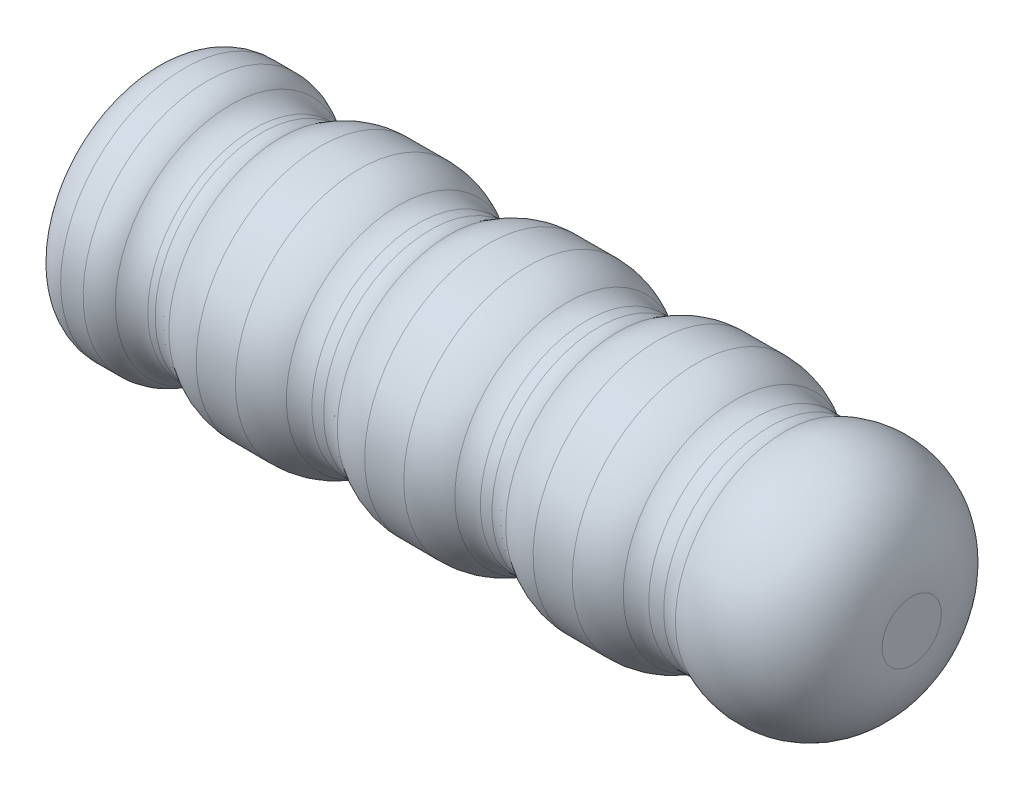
ISO-10303-21;
HEADER;
FILE_DESCRIPTION(('STEP AP214'),'2;1');
FILE_NAME('part.step','',(''),(''),'','','');
FILE_SCHEMA(('AUTOMOTIVE_DESIGN { 1 0 10303 214 1 1 1 1 }'));
ENDSEC;
DATA;
#1=APPLICATION_CONTEXT('core data for automotive mechanical design processes');
#2=APPLICATION_PROTOCOL_DEFINITION('international standard','automotive_design',2000,#1);
#3=PRODUCT_CONTEXT('',#1,'mechanical');
#4=PRODUCT('Part','Part','',(#3));
#5=PRODUCT_RELATED_PRODUCT_CATEGORY('part','',(#4));
#6=PRODUCT_DEFINITION_FORMATION('','',#4);
#7=PRODUCT_DEFINITION_CONTEXT('part definition',#1,'design');
#8=PRODUCT_DEFINITION('design','',#6,#7);
#9=PRODUCT_DEFINITION_SHAPE('','',#8);
#10=(LENGTH_UNIT() NAMED_UNIT(*) SI_UNIT(.MILLI.,.METRE.));
#11=(NAMED_UNIT(*) PLANE_ANGLE_UNIT() SI_UNIT($,.RADIAN.));
#12=(NAMED_UNIT(*) SI_UNIT($,.STERADIAN.) SOLID_ANGLE_UNIT());
#13=UNCERTAINTY_MEASURE_WITH_UNIT(LENGTH_MEASURE(1.E-05),#10,'distance_accuracy_value','');
#14=(GEOMETRIC_REPRESENTATION_CONTEXT(3) GLOBAL_UNCERTAINTY_ASSIGNED_CONTEXT((#13)) GLOBAL_UNIT_ASSIGNED_CONTEXT((#10,
#11,#12)) REPRESENTATION_CONTEXT('',''));
#15=CARTESIAN_POINT('',(0.,0.,0.));
#16=DIRECTION('',(0.,0.,1.));
#17=DIRECTION('',(1.,0.,0.));
#18=AXIS2_PLACEMENT_3D('',#15,#16,#17);
#19=CARTESIAN_POINT('',(420.010002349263,114.259498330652,0.));
#20=DIRECTION('',(1.,0.,0.));
#21=DIRECTION('',(0.,0.,-1.));
#22=AXIS2_PLACEMENT_3D('',#19,#20,#21);
#23=PLANE('',#22);
#24=CARTESIAN_POINT('',(420.010002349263,107.259498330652,0.));
#25=DIRECTION('',(-1.,0.,0.));
#26=DIRECTION('',(0.,-1.,0.));
#27=AXIS2_PLACEMENT_3D('',#24,#25,#26);
#28=CIRCLE('',#27,3.33974596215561);
#29=CARTESIAN_POINT('',(420.010002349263,103.919752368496,0.));
#30=VERTEX_POINT('',#29);
#31=CARTESIAN_POINT('',(420.010002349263,110.599244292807,0.));
#32=VERTEX_POINT('',#31);
#33=EDGE_CURVE('E59',#30,#32,#28,.T.);
#34=ORIENTED_EDGE('',*,*,#33,.F.);
#35=CARTESIAN_POINT('',(420.010002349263,107.259498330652,0.));
#36=DIRECTION('',(-1.,0.,0.));
#37=DIRECTION('',(0.,1.,0.));
#38=AXIS2_PLACEMENT_3D('',#35,#36,#37);
#39=CIRCLE('',#38,3.33974596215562);
#40=EDGE_CURVE('E61',#32,#30,#39,.T.);
#41=ORIENTED_EDGE('',*,*,#40,.F.);
#42=EDGE_LOOP('',(#34,#41));
#43=FACE_BOUND('',#42,.T.);
#44=ADVANCED_FACE('F14',(#43),#23,.T.);
#45=CARTESIAN_POINT('',(410.010002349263,110.599244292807,0.));
#46=DIRECTION('',(0.,0.,1.));
#47=DIRECTION('',(0.,1.,0.));
#48=AXIS2_PLACEMENT_3D('',#45,#46,#47);
#49=CIRCLE('',#48,10.);
#50=TRIMMED_CURVE('',#49,(PARAMETER_VALUE(-1.91131348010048)),
(PARAMETER_VALUE(1.91131348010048)),.T.,.PARAMETER.);
#51=CARTESIAN_POINT('',(410.010002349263,107.259498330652,0.));
#52=DIRECTION('',(1.,0.,0.));
#53=AXIS1_PLACEMENT('',#51,#52);
#54=SURFACE_OF_REVOLUTION('',#50,#53);
#55=ORIENTED_EDGE('',*,*,#33,.T.);
#56=ORIENTED_EDGE('',*,*,#40,.T.);
#57=EDGE_LOOP('',(#55,#56));
#58=FACE_BOUND('',#57,.T.);
#59=CARTESIAN_POINT('',(405.741108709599,107.259498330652,0.));
#60=DIRECTION('',(1.,0.,0.));
#61=DIRECTION('',(0.,0.,-1.));
#62=AXIS2_PLACEMENT_3D('',#59,#60,#61);
#63=CIRCLE('',#62,12.3827845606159);
#64=CARTESIAN_POINT('',(405.741108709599,107.259498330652,-12.3827845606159));
#65=VERTEX_POINT('',#64);
#66=EDGE_CURVE('E67',#65,#65,#63,.F.);
#67=ORIENTED_EDGE('',*,*,#66,.F.);
#68=EDGE_LOOP('',(#67));
#69=FACE_BOUND('',#68,.T.);
#70=ADVANCED_FACE('F63',(#58,#69),#54,.F.);
#71=CARTESIAN_POINT('',(404.033551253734,107.259498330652,0.));
#72=DIRECTION('',(1.,0.,0.));
#73=DIRECTION('',(0.,0.,-1.));
#74=AXIS2_PLACEMENT_3D('',#71,#72,#73);
#75=TOROIDAL_SURFACE('',#74,16.,4.);
#76=ORIENTED_EDGE('',*,*,#66,.T.);
#77=EDGE_LOOP('',(#76));
#78=FACE_BOUND('',#77,.T.);
#79=CARTESIAN_POINT('',(404.033551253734,107.259498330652,0.));
#80=DIRECTION('',(1.,0.,0.));
#81=DIRECTION('',(0.,0.,-1.));
#82=AXIS2_PLACEMENT_3D('',#79,#80,#81);
#83=CIRCLE('',#82,12.);
#84=CARTESIAN_POINT('',(404.033551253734,107.259498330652,-12.));
#85=VERTEX_POINT('',#84);
#86=EDGE_CURVE('E107',#85,#85,#83,.F.);
#87=ORIENTED_EDGE('',*,*,#86,.F.);
#88=EDGE_LOOP('',(#87));
#89=FACE_BOUND('',#88,.T.);
#90=ADVANCED_FACE('F94',(#78,#89),#75,.F.);
#91=CARTESIAN_POINT('',(403.010002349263,107.259498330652,0.));
#92=DIRECTION('',(1.,0.,0.));
#93=DIRECTION('',(0.,0.,-1.));
#94=AXIS2_PLACEMENT_3D('',#91,#92,#93);
#95=CYLINDRICAL_SURFACE('',#94,12.);
#96=ORIENTED_EDGE('',*,*,#86,.T.);
#97=EDGE_LOOP('',(#96));
#98=FACE_BOUND('',#97,.T.);
#99=CARTESIAN_POINT('',(402.351749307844,107.259498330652,0.));
#100=DIRECTION('',(1.,0.,0.));
#101=DIRECTION('',(0.,0.,-1.));
#102=AXIS2_PLACEMENT_3D('',#99,#100,#101);
#103=CIRCLE('',#102,12.);
#104=CARTESIAN_POINT('',(402.351749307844,107.259498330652,-12.));
#105=VERTEX_POINT('',#104);
#106=EDGE_CURVE('E112',#105,#105,#103,.F.);
#107=ORIENTED_EDGE('',*,*,#106,.F.);
#108=EDGE_LOOP('',(#107));
#109=FACE_BOUND('',#108,.T.);
#110=ADVANCED_FACE('F127',(#98,#109),#95,.T.);
#111=CARTESIAN_POINT('',(402.351749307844,107.259498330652,0.));
#112=DIRECTION('',(1.,0.,0.));
#113=DIRECTION('',(0.,0.,-1.));
#114=AXIS2_PLACEMENT_3D('',#111,#112,#113);
#115=TOROIDAL_SURFACE('',#114,16.,4.);
#116=ORIENTED_EDGE('',*,*,#106,.T.);
#117=EDGE_LOOP('',(#116));
#118=FACE_BOUND('',#117,.T.);
#119=CARTESIAN_POINT('',(400.140666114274,107.259498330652,0.));
#120=DIRECTION('',(-1.,0.,0.));
#121=DIRECTION('',(0.,1.,0.));
#122=AXIS2_PLACEMENT_3D('',#119,#120,#121);
#123=CIRCLE('',#122,12.6666666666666);
#124=CARTESIAN_POINT('',(400.140666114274,119.926164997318,0.));
#125=VERTEX_POINT('',#124);
#126=EDGE_CURVE('E116',#125,#125,#123,.T.);
#127=ORIENTED_EDGE('',*,*,#126,.F.);
#128=EDGE_LOOP('',(#127));
#129=FACE_BOUND('',#128,.T.);
#130=ADVANCED_FACE('F123',(#118,#129),#115,.F.);
#131=CARTESIAN_POINT('',(395.718499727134,113.259498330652,0.));
#132=DIRECTION('',(0.,0.,-1.));
#133=DIRECTION('',(0.,1.,0.));
#134=AXIS2_PLACEMENT_3D('',#131,#132,#133);
#135=CIRCLE('',#134,8.);
#136=TRIMMED_CURVE('',#135,(PARAMETER_VALUE(-2.41885840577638)),
(PARAMETER_VALUE(2.41885840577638)),.T.,.PARAMETER.);
#137=CARTESIAN_POINT('',(395.718499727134,107.259498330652,0.));
#138=DIRECTION('',(-1.,0.,0.));
#139=AXIS1_PLACEMENT('',#137,#138);
#140=SURFACE_OF_REVOLUTION('',#136,#139);
#141=ORIENTED_EDGE('',*,*,#126,.T.);
#142=EDGE_LOOP('',(#141));
#143=FACE_BOUND('',#142,.T.);
#144=CARTESIAN_POINT('',(395.718499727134,107.259498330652,0.));
#145=DIRECTION('',(1.,0.,0.));
#146=DIRECTION('',(0.,0.,-1.));
#147=AXIS2_PLACEMENT_3D('',#144,#145,#146);
#148=CIRCLE('',#147,14.);
#149=CARTESIAN_POINT('',(395.718499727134,107.259498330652,-14.));
#150=VERTEX_POINT('',#149);
#151=EDGE_CURVE('E331',#150,#150,#148,.F.);
#152=ORIENTED_EDGE('',*,*,#151,.F.);
#153=EDGE_LOOP('',(#152));
#154=FACE_BOUND('',#153,.T.);
#155=ADVANCED_FACE('F126',(#143,#154),#140,.F.);
#156=CARTESIAN_POINT('',(393.510002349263,107.259498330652,0.));
#157=DIRECTION('',(1.,0.,0.));
#158=DIRECTION('',(0.,0.,-1.));
#159=AXIS2_PLACEMENT_3D('',#156,#157,#158);
#160=CYLINDRICAL_SURFACE('',#159,14.);
#161=ORIENTED_EDGE('',*,*,#151,.T.);
#162=EDGE_LOOP('',(#161));
#163=FACE_BOUND('',#162,.T.);
#164=CARTESIAN_POINT('',(391.301504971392,107.259498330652,0.));
#165=DIRECTION('',(1.,0.,0.));
#166=DIRECTION('',(0.,1.,0.));
#167=AXIS2_PLACEMENT_3D('',#164,#165,#166);
#168=CIRCLE('',#167,14.);
#169=CARTESIAN_POINT('',(391.301504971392,121.259498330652,0.));
#170=VERTEX_POINT('',#169);
#171=EDGE_CURVE('E328',#170,#170,#168,.F.);
#172=ORIENTED_EDGE('',*,*,#171,.F.);
#173=EDGE_LOOP('',(#172));
#174=FACE_BOUND('',#173,.T.);
#175=ADVANCED_FACE('F324',(#163,#174),#160,.T.);
#176=CARTESIAN_POINT('',(391.301504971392,113.259498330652,0.));
#177=DIRECTION('',(0.,0.,1.));
#178=DIRECTION('',(0.,1.,0.));
#179=AXIS2_PLACEMENT_3D('',#176,#177,#178);
#180=CIRCLE('',#179,8.);
#181=TRIMMED_CURVE('',#180,(PARAMETER_VALUE(-2.41885840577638)),
(PARAMETER_VALUE(2.41885840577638)),.T.,.PARAMETER.);
#182=CARTESIAN_POINT('',(391.301504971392,107.259498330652,0.));
#183=DIRECTION('',(1.,0.,0.));
#184=AXIS1_PLACEMENT('',#182,#183);
#185=SURFACE_OF_REVOLUTION('',#181,#184);
#186=ORIENTED_EDGE('',*,*,#171,.T.);
#187=EDGE_LOOP('',(#186));
#188=FACE_BOUND('',#187,.T.);
#189=CARTESIAN_POINT('',(386.879338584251,107.259498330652,0.));
#190=DIRECTION('',(1.,0.,0.));
#191=DIRECTION('',(0.,0.,-1.));
#192=AXIS2_PLACEMENT_3D('',#189,#190,#191);
#193=CIRCLE('',#192,12.6666666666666);
#194=CARTESIAN_POINT('',(386.879338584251,107.259498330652,-12.6666666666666));
#195=VERTEX_POINT('',#194);
#196=EDGE_CURVE('E314',#195,#195,#193,.F.);
#197=ORIENTED_EDGE('',*,*,#196,.F.);
#198=EDGE_LOOP('',(#197));
#199=FACE_BOUND('',#198,.T.);
#200=ADVANCED_FACE('F321',(#188,#199),#185,.F.);
#201=CARTESIAN_POINT('',(384.668255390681,107.259498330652,0.));
#202=DIRECTION('',(1.,0.,0.));
#203=DIRECTION('',(0.,0.,-1.));
#204=AXIS2_PLACEMENT_3D('',#201,#202,#203);
#205=TOROIDAL_SURFACE('',#204,16.,4.);
#206=ORIENTED_EDGE('',*,*,#196,.T.);
#207=EDGE_LOOP('',(#206));
#208=FACE_BOUND('',#207,.T.);
#209=CARTESIAN_POINT('',(384.668255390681,107.259498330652,0.));
#210=DIRECTION('',(1.,0.,0.));
#211=DIRECTION('',(0.,0.,-1.));
#212=AXIS2_PLACEMENT_3D('',#209,#210,#211);
#213=CIRCLE('',#212,12.);
#214=CARTESIAN_POINT('',(384.668255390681,107.259498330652,-12.));
#215=VERTEX_POINT('',#214);
#216=EDGE_CURVE('E311',#215,#215,#213,.F.);
#217=ORIENTED_EDGE('',*,*,#216,.F.);
#218=EDGE_LOOP('',(#217));
#219=FACE_BOUND('',#218,.T.);
#220=ADVANCED_FACE('F318',(#208,#219),#205,.F.);
#221=CARTESIAN_POINT('',(384.010002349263,107.259498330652,0.));
#222=DIRECTION('',(1.,0.,0.));
#223=DIRECTION('',(0.,0.,-1.));
#224=AXIS2_PLACEMENT_3D('',#221,#222,#223);
#225=CYLINDRICAL_SURFACE('',#224,12.);
#226=ORIENTED_EDGE('',*,*,#216,.T.);
#227=EDGE_LOOP('',(#226));
#228=FACE_BOUND('',#227,.T.);
#229=CARTESIAN_POINT('',(383.351749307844,107.259498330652,0.));
#230=DIRECTION('',(1.,0.,0.));
#231=DIRECTION('',(0.,0.,-1.));
#232=AXIS2_PLACEMENT_3D('',#229,#230,#231);
#233=CIRCLE('',#232,12.);
#234=CARTESIAN_POINT('',(383.351749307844,107.259498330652,-12.));
#235=VERTEX_POINT('',#234);
#236=EDGE_CURVE('E308',#235,#235,#233,.F.);
#237=ORIENTED_EDGE('',*,*,#236,.F.);
#238=EDGE_LOOP('',(#237));
#239=FACE_BOUND('',#238,.T.);
#240=ADVANCED_FACE('F303',(#228,#239),#225,.T.);
#241=CARTESIAN_POINT('',(383.351749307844,107.259498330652,0.));
#242=DIRECTION('',(1.,0.,0.));
#243=DIRECTION('',(0.,0.,-1.));
#244=AXIS2_PLACEMENT_3D('',#241,#242,#243);
#245=TOROIDAL_SURFACE('',#244,16.,4.);
#246=ORIENTED_EDGE('',*,*,#236,.T.);
#247=EDGE_LOOP('',(#246));
#248=FACE_BOUND('',#247,.T.);
#249=CARTESIAN_POINT('',(381.140666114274,107.259498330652,0.));
#250=DIRECTION('',(-1.,0.,0.));
#251=DIRECTION('',(0.,1.,0.));
#252=AXIS2_PLACEMENT_3D('',#249,#250,#251);
#253=CIRCLE('',#252,12.6666666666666);
#254=CARTESIAN_POINT('',(381.140666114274,119.926164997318,0.));
#255=VERTEX_POINT('',#254);
#256=EDGE_CURVE('E292',#255,#255,#253,.T.);
#257=ORIENTED_EDGE('',*,*,#256,.F.);
#258=EDGE_LOOP('',(#257));
#259=FACE_BOUND('',#258,.T.);
#260=ADVANCED_FACE('F299',(#248,#259),#245,.F.);
#261=CARTESIAN_POINT('',(376.718499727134,113.259498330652,0.));
#262=DIRECTION('',(0.,0.,-1.));
#263=DIRECTION('',(0.,1.,0.));
#264=AXIS2_PLACEMENT_3D('',#261,#262,#263);
#265=CIRCLE('',#264,8.);
#266=TRIMMED_CURVE('',#265,(PARAMETER_VALUE(-2.41885840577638)),
(PARAMETER_VALUE(2.41885840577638)),.T.,.PARAMETER.);
#267=CARTESIAN_POINT('',(376.718499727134,107.259498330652,0.));
#268=DIRECTION('',(-1.,0.,0.));
#269=AXIS1_PLACEMENT('',#267,#268);
#270=SURFACE_OF_REVOLUTION('',#266,#269);
#271=ORIENTED_EDGE('',*,*,#256,.T.);
#272=EDGE_LOOP('',(#271));
#273=FACE_BOUND('',#272,.T.);
#274=CARTESIAN_POINT('',(376.718499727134,107.259498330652,0.));
#275=DIRECTION('',(1.,0.,0.));
#276=DIRECTION('',(0.,0.,-1.));
#277=AXIS2_PLACEMENT_3D('',#274,#275,#276);
#278=CIRCLE('',#277,14.);
#279=CARTESIAN_POINT('',(376.718499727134,107.259498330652,-14.));
#280=VERTEX_POINT('',#279);
#281=EDGE_CURVE('E289',#280,#280,#278,.F.);
#282=ORIENTED_EDGE('',*,*,#281,.F.);
#283=EDGE_LOOP('',(#282));
#284=FACE_BOUND('',#283,.T.);
#285=ADVANCED_FACE('F296',(#273,#284),#270,.F.);
#286=CARTESIAN_POINT('',(374.510002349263,107.259498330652,0.));
#287=DIRECTION('',(1.,0.,0.));
#288=DIRECTION('',(0.,0.,-1.));
#289=AXIS2_PLACEMENT_3D('',#286,#287,#288);
#290=CYLINDRICAL_SURFACE('',#289,14.);
#291=ORIENTED_EDGE('',*,*,#281,.T.);
#292=EDGE_LOOP('',(#291));
#293=FACE_BOUND('',#292,.T.);
#294=CARTESIAN_POINT('',(372.301504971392,107.259498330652,0.));
#295=DIRECTION('',(1.,0.,0.));
#296=DIRECTION('',(0.,1.,0.));
#297=AXIS2_PLACEMENT_3D('',#294,#295,#296);
#298=CIRCLE('',#297,14.);
#299=CARTESIAN_POINT('',(372.301504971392,121.259498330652,0.));
#300=VERTEX_POINT('',#299);
#301=EDGE_CURVE('E286',#300,#300,#298,.F.);
#302=ORIENTED_EDGE('',*,*,#301,.F.);
#303=EDGE_LOOP('',(#302));
#304=FACE_BOUND('',#303,.T.);
#305=ADVANCED_FACE('F281',(#293,#304),#290,.T.);
#306=CARTESIAN_POINT('',(372.301504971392,113.259498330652,0.));
#307=DIRECTION('',(0.,0.,1.));
#308=DIRECTION('',(0.,1.,0.));
#309=AXIS2_PLACEMENT_3D('',#306,#307,#308);
#310=CIRCLE('',#309,8.);
#311=TRIMMED_CURVE('',#310,(PARAMETER_VALUE(-2.41885840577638)),
(PARAMETER_VALUE(2.41885840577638)),.T.,.PARAMETER.);
#312=CARTESIAN_POINT('',(372.301504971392,107.259498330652,0.));
#313=DIRECTION('',(1.,0.,0.));
#314=AXIS1_PLACEMENT('',#312,#313);
#315=SURFACE_OF_REVOLUTION('',#311,#314);
#316=ORIENTED_EDGE('',*,*,#301,.T.);
#317=EDGE_LOOP('',(#316));
#318=FACE_BOUND('',#317,.T.);
#319=CARTESIAN_POINT('',(367.879338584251,107.259498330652,0.));
#320=DIRECTION('',(1.,0.,0.));
#321=DIRECTION('',(0.,0.,-1.));
#322=AXIS2_PLACEMENT_3D('',#319,#320,#321);
#323=CIRCLE('',#322,12.6666666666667);
#324=CARTESIAN_POINT('',(367.879338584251,107.259498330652,-12.6666666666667));
#325=VERTEX_POINT('',#324);
#326=EDGE_CURVE('E270',#325,#325,#323,.F.);
#327=ORIENTED_EDGE('',*,*,#326,.F.);
#328=EDGE_LOOP('',(#327));
#329=FACE_BOUND('',#328,.T.);
#330=ADVANCED_FACE('F277',(#318,#329),#315,.F.);
#331=CARTESIAN_POINT('',(365.668255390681,107.259498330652,0.));
#332=DIRECTION('',(1.,0.,0.));
#333=DIRECTION('',(0.,0.,-1.));
#334=AXIS2_PLACEMENT_3D('',#331,#332,#333);
#335=TOROIDAL_SURFACE('',#334,16.,4.);
#336=ORIENTED_EDGE('',*,*,#326,.T.);
#337=EDGE_LOOP('',(#336));
#338=FACE_BOUND('',#337,.T.);
#339=CARTESIAN_POINT('',(365.668255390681,107.259498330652,0.));
#340=DIRECTION('',(1.,0.,0.));
#341=DIRECTION('',(0.,0.,-1.));
#342=AXIS2_PLACEMENT_3D('',#339,#340,#341);
#343=CIRCLE('',#342,12.);
#344=CARTESIAN_POINT('',(365.668255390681,107.259498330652,-12.));
#345=VERTEX_POINT('',#344);
#346=EDGE_CURVE('E267',#345,#345,#343,.F.);
#347=ORIENTED_EDGE('',*,*,#346,.F.);
#348=EDGE_LOOP('',(#347));
#349=FACE_BOUND('',#348,.T.);
#350=ADVANCED_FACE('F274',(#338,#349),#335,.F.);
#351=CARTESIAN_POINT('',(365.010002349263,107.259498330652,0.));
#352=DIRECTION('',(1.,0.,0.));
#353=DIRECTION('',(0.,0.,-1.));
#354=AXIS2_PLACEMENT_3D('',#351,#352,#353);
#355=CYLINDRICAL_SURFACE('',#354,12.);
#356=ORIENTED_EDGE('',*,*,#346,.T.);
#357=EDGE_LOOP('',(#356));
#358=FACE_BOUND('',#357,.T.);
#359=CARTESIAN_POINT('',(364.351749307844,107.259498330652,0.));
#360=DIRECTION('',(1.,0.,0.));
#361=DIRECTION('',(0.,0.,-1.));
#362=AXIS2_PLACEMENT_3D('',#359,#360,#361);
#363=CIRCLE('',#362,12.);
#364=CARTESIAN_POINT('',(364.351749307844,107.259498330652,-12.));
#365=VERTEX_POINT('',#364);
#366=EDGE_CURVE('E264',#365,#365,#363,.F.);
#367=ORIENTED_EDGE('',*,*,#366,.F.);
#368=EDGE_LOOP('',(#367));
#369=FACE_BOUND('',#368,.T.);
#370=ADVANCED_FACE('F259',(#358,#369),#355,.T.);
#371=CARTESIAN_POINT('',(364.351749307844,107.259498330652,0.));
#372=DIRECTION('',(1.,0.,0.));
#373=DIRECTION('',(0.,0.,-1.));
#374=AXIS2_PLACEMENT_3D('',#371,#372,#373);
#375=TOROIDAL_SURFACE('',#374,16.,4.);
#376=ORIENTED_EDGE('',*,*,#366,.T.);
#377=EDGE_LOOP('',(#376));
#378=FACE_BOUND('',#377,.T.);
#379=CARTESIAN_POINT('',(362.140666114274,107.259498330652,0.));
#380=DIRECTION('',(-1.,0.,0.));
#381=DIRECTION('',(0.,1.,0.));
#382=AXIS2_PLACEMENT_3D('',#379,#380,#381);
#383=CIRCLE('',#382,12.6666666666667);
#384=CARTESIAN_POINT('',(362.140666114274,119.926164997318,0.));
#385=VERTEX_POINT('',#384);
#386=EDGE_CURVE('E248',#385,#385,#383,.T.);
#387=ORIENTED_EDGE('',*,*,#386,.F.);
#388=EDGE_LOOP('',(#387));
#389=FACE_BOUND('',#388,.T.);
#390=ADVANCED_FACE('F255',(#378,#389),#375,.F.);
#391=CARTESIAN_POINT('',(357.718499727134,113.259498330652,0.));
#392=DIRECTION('',(0.,0.,-1.));
#393=DIRECTION('',(0.,1.,0.));
#394=AXIS2_PLACEMENT_3D('',#391,#392,#393);
#395=CIRCLE('',#394,8.);
#396=TRIMMED_CURVE('',#395,(PARAMETER_VALUE(-2.41885840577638)),
(PARAMETER_VALUE(2.41885840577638)),.T.,.PARAMETER.);
#397=CARTESIAN_POINT('',(357.718499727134,107.259498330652,0.));
#398=DIRECTION('',(-1.,0.,0.));
#399=AXIS1_PLACEMENT('',#397,#398);
#400=SURFACE_OF_REVOLUTION('',#396,#399);
#401=ORIENTED_EDGE('',*,*,#386,.T.);
#402=EDGE_LOOP('',(#401));
#403=FACE_BOUND('',#402,.T.);
#404=CARTESIAN_POINT('',(357.718499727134,107.259498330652,0.));
#405=DIRECTION('',(1.,0.,0.));
#406=DIRECTION('',(0.,0.,-1.));
#407=AXIS2_PLACEMENT_3D('',#404,#405,#406);
#408=CIRCLE('',#407,14.);
#409=CARTESIAN_POINT('',(357.718499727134,107.259498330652,-14.));
#410=VERTEX_POINT('',#409);
#411=EDGE_CURVE('E245',#410,#410,#408,.F.);
#412=ORIENTED_EDGE('',*,*,#411,.F.);
#413=EDGE_LOOP('',(#412));
#414=FACE_BOUND('',#413,.T.);
#415=ADVANCED_FACE('F252',(#403,#414),#400,.F.);
#416=CARTESIAN_POINT('',(355.510002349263,107.259498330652,0.));
#417=DIRECTION('',(1.,0.,0.));
#418=DIRECTION('',(0.,0.,-1.));
#419=AXIS2_PLACEMENT_3D('',#416,#417,#418);
#420=CYLINDRICAL_SURFACE('',#419,14.);
#421=ORIENTED_EDGE('',*,*,#411,.T.);
#422=EDGE_LOOP('',(#421));
#423=FACE_BOUND('',#422,.T.);
#424=CARTESIAN_POINT('',(353.301504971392,107.259498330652,0.));
#425=DIRECTION('',(1.,0.,0.));
#426=DIRECTION('',(0.,1.,0.));
#427=AXIS2_PLACEMENT_3D('',#424,#425,#426);
#428=CIRCLE('',#427,14.);
#429=CARTESIAN_POINT('',(353.301504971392,121.259498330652,0.));
#430=VERTEX_POINT('',#429);
#431=EDGE_CURVE('E242',#430,#430,#428,.F.);
#432=ORIENTED_EDGE('',*,*,#431,.F.);
#433=EDGE_LOOP('',(#432));
#434=FACE_BOUND('',#433,.T.);
#435=ADVANCED_FACE('F237',(#423,#434),#420,.T.);
#436=CARTESIAN_POINT('',(353.301504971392,113.259498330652,0.));
#437=DIRECTION('',(0.,0.,1.));
#438=DIRECTION('',(0.,1.,0.));
#439=AXIS2_PLACEMENT_3D('',#436,#437,#438);
#440=CIRCLE('',#439,8.);
#441=TRIMMED_CURVE('',#440,(PARAMETER_VALUE(-2.41885840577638)),
(PARAMETER_VALUE(2.41885840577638)),.T.,.PARAMETER.);
#442=CARTESIAN_POINT('',(353.301504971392,107.259498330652,0.));
#443=DIRECTION('',(1.,0.,0.));
#444=AXIS1_PLACEMENT('',#442,#443);
#445=SURFACE_OF_REVOLUTION('',#441,#444);
#446=ORIENTED_EDGE('',*,*,#431,.T.);
#447=EDGE_LOOP('',(#446));
#448=FACE_BOUND('',#447,.T.);
#449=CARTESIAN_POINT('',(348.879338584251,107.259498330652,0.));
#450=DIRECTION('',(1.,0.,0.));
#451=DIRECTION('',(0.,0.,-1.));
#452=AXIS2_PLACEMENT_3D('',#449,#450,#451);
#453=CIRCLE('',#452,12.6666666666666);
#454=CARTESIAN_POINT('',(348.879338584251,107.259498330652,-12.6666666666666));
#455=VERTEX_POINT('',#454);
#456=EDGE_CURVE('E226',#455,#455,#453,.F.);
#457=ORIENTED_EDGE('',*,*,#456,.F.);
#458=EDGE_LOOP('',(#457));
#459=FACE_BOUND('',#458,.T.);
#460=ADVANCED_FACE('F233',(#448,#459),#445,.F.);
#461=CARTESIAN_POINT('',(346.668255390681,107.259498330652,0.));
#462=DIRECTION('',(1.,0.,0.));
#463=DIRECTION('',(0.,0.,-1.));
#464=AXIS2_PLACEMENT_3D('',#461,#462,#463);
#465=TOROIDAL_SURFACE('',#464,16.,4.);
#466=ORIENTED_EDGE('',*,*,#456,.T.);
#467=EDGE_LOOP('',(#466));
#468=FACE_BOUND('',#467,.T.);
#469=CARTESIAN_POINT('',(346.668255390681,107.259498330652,0.));
#470=DIRECTION('',(1.,0.,0.));
#471=DIRECTION('',(0.,0.,-1.));
#472=AXIS2_PLACEMENT_3D('',#469,#470,#471);
#473=CIRCLE('',#472,12.);
#474=CARTESIAN_POINT('',(346.668255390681,107.259498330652,-12.));
#475=VERTEX_POINT('',#474);
#476=EDGE_CURVE('E223',#475,#475,#473,.F.);
#477=ORIENTED_EDGE('',*,*,#476,.F.);
#478=EDGE_LOOP('',(#477));
#479=FACE_BOUND('',#478,.T.);
#480=ADVANCED_FACE('F230',(#468,#479),#465,.F.);
#481=CARTESIAN_POINT('',(346.010002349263,107.259498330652,0.));
#482=DIRECTION('',(1.,0.,0.));
#483=DIRECTION('',(0.,0.,-1.));
#484=AXIS2_PLACEMENT_3D('',#481,#482,#483);
#485=CYLINDRICAL_SURFACE('',#484,12.);
#486=CARTESIAN_POINT('',(345.837403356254,107.259498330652,0.));
#487=DIRECTION('',(-1.,0.,0.));
#488=DIRECTION('',(0.,0.,1.));
#489=AXIS2_PLACEMENT_3D('',#486,#487,#488);
#490=CIRCLE('',#489,12.);
#491=CARTESIAN_POINT('',(345.837403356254,107.259498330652,12.));
#492=VERTEX_POINT('',#491);
#493=EDGE_CURVE('E220',#492,#492,#490,.T.);
#494=ORIENTED_EDGE('',*,*,#493,.F.);
#495=EDGE_LOOP('',(#494));
#496=FACE_BOUND('',#495,.T.);
#497=ORIENTED_EDGE('',*,*,#476,.T.);
#498=EDGE_LOOP('',(#497));
#499=FACE_BOUND('',#498,.T.);
#500=ADVANCED_FACE('F215',(#496,#499),#485,.T.);
#501=CARTESIAN_POINT('',(345.837403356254,107.259498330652,0.));
#502=DIRECTION('',(-1.,0.,0.));
#503=DIRECTION('',(0.,0.,1.));
#504=AXIS2_PLACEMENT_3D('',#501,#502,#503);
#505=TOROIDAL_SURFACE('',#504,16.,4.);
#506=CARTESIAN_POINT('',(343.19165204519,107.259498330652,0.));
#507=DIRECTION('',(-1.,0.,0.));
#508=DIRECTION('',(0.,1.,0.));
#509=AXIS2_PLACEMENT_3D('',#506,#507,#508);
#510=CIRCLE('',#509,13.);
#511=CARTESIAN_POINT('',(343.19165204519,120.259498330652,0.));
#512=VERTEX_POINT('',#511);
#513=EDGE_CURVE('E204',#512,#512,#510,.T.);
#514=ORIENTED_EDGE('',*,*,#513,.F.);
#515=EDGE_LOOP('',(#514));
#516=FACE_BOUND('',#515,.T.);
#517=ORIENTED_EDGE('',*,*,#493,.T.);
#518=EDGE_LOOP('',(#517));
#519=FACE_BOUND('',#518,.T.);
#520=ADVANCED_FACE('F211',(#516,#519),#505,.F.);
#521=CARTESIAN_POINT('',(340.545900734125,107.259498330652,0.));
#522=DIRECTION('',(-1.,0.,0.));
#523=DIRECTION('',(0.,1.,0.));
#524=AXIS2_PLACEMENT_3D('',#521,#522,#523);
#525=TOROIDAL_SURFACE('',#524,9.99999999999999,4.);
#526=CARTESIAN_POINT('',(340.545900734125,107.259498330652,0.));
#527=DIRECTION('',(1.,0.,0.));
#528=DIRECTION('',(0.,0.,-1.));
#529=AXIS2_PLACEMENT_3D('',#526,#527,#528);
#530=CIRCLE('',#529,14.);
#531=CARTESIAN_POINT('',(340.545900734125,107.259498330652,-14.));
#532=VERTEX_POINT('',#531);
#533=EDGE_CURVE('E196',#532,#532,#530,.F.);
#534=ORIENTED_EDGE('',*,*,#533,.F.);
#535=EDGE_LOOP('',(#534));
#536=FACE_BOUND('',#535,.T.);
#537=ORIENTED_EDGE('',*,*,#513,.T.);
#538=EDGE_LOOP('',(#537));
#539=FACE_BOUND('',#538,.T.);
#540=ADVANCED_FACE('F208',(#536,#539),#525,.T.);
#541=CARTESIAN_POINT('',(339.010002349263,107.259498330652,0.));
#542=DIRECTION('',(1.,0.,0.));
#543=DIRECTION('',(0.,0.,-1.));
#544=AXIS2_PLACEMENT_3D('',#541,#542,#543);
#545=CYLINDRICAL_SURFACE('',#544,14.);
#546=CARTESIAN_POINT('',(338.010002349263,107.259498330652,0.));
#547=DIRECTION('',(1.,0.,0.));
#548=DIRECTION('',(0.,0.,-1.));
#549=AXIS2_PLACEMENT_3D('',#546,#547,#548);
#550=CIRCLE('',#549,14.);
#551=CARTESIAN_POINT('',(338.010002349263,107.259498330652,-14.));
#552=VERTEX_POINT('',#551);
#553=EDGE_CURVE('E178',#552,#552,#550,.F.);
#554=ORIENTED_EDGE('',*,*,#553,.F.);
#555=EDGE_LOOP('',(#554));
#556=FACE_BOUND('',#555,.T.);
#557=ORIENTED_EDGE('',*,*,#533,.T.);
#558=EDGE_LOOP('',(#557));
#559=FACE_BOUND('',#558,.T.);
#560=ADVANCED_FACE('F188',(#556,#559),#545,.T.);
#561=CARTESIAN_POINT('',(338.010002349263,107.259498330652,0.));
#562=DIRECTION('',(1.,0.,0.));
#563=DIRECTION('',(0.,0.,-1.));
#564=AXIS2_PLACEMENT_3D('',#561,#562,#563);
#565=TOROIDAL_SURFACE('',#564,10.,4.);
#566=ORIENTED_EDGE('',*,*,#553,.T.);
#567=EDGE_LOOP('',(#566));
#568=FACE_BOUND('',#567,.T.);
#569=CARTESIAN_POINT('',(334.010002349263,107.259498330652,0.));
#570=DIRECTION('',(1.,0.,0.));
#571=DIRECTION('',(0.,1.,0.));
#572=AXIS2_PLACEMENT_3D('',#569,#570,#571);
#573=CIRCLE('',#572,10.);
#574=CARTESIAN_POINT('',(334.010002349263,117.259498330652,0.));
#575=VERTEX_POINT('',#574);
#576=EDGE_CURVE('E172',#575,#575,#573,.F.);
#577=ORIENTED_EDGE('',*,*,#576,.F.);
#578=EDGE_LOOP('',(#577));
#579=FACE_BOUND('',#578,.T.);
#580=ADVANCED_FACE('F183',(#568,#579),#565,.T.);
#581=CARTESIAN_POINT('',(334.010002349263,114.609498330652,-2.85));
#582=DIRECTION('',(0.,0.,-1.));
#583=DIRECTION('',(-1.,0.,0.));
#584=AXIS2_PLACEMENT_3D('',#581,#582,#583);
#585=PLANE('',#584);
#586=DIRECTION('',(1.,0.,0.));
#587=VECTOR('',#586,1.);
#588=CARTESIAN_POINT('',(334.010002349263,114.609498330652,-2.85));
#589=LINE('',#588,#587);
#590=CARTESIAN_POINT('',(418.010002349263,114.609498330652,-2.85));
#591=VERTEX_POINT('',#590);
#592=CARTESIAN_POINT('',(334.010002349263,114.609498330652,-2.85));
#593=VERTEX_POINT('',#592);
#594=EDGE_CURVE('E175',#591,#593,#589,.F.);
#595=ORIENTED_EDGE('',*,*,#594,.T.);
#596=DIRECTION('',(0.,1.,0.));
#597=VECTOR('',#596,1.);
#598=CARTESIAN_POINT('',(334.010002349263,114.259498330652,-2.85));
#599=LINE('',#598,#597);
#600=CARTESIAN_POINT('',(334.010002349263,99.9094983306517,-2.85));
#601=VERTEX_POINT('',#600);
#602=EDGE_CURVE('E173',#601,#593,#599,.T.);
#603=ORIENTED_EDGE('',*,*,#602,.F.);
#604=DIRECTION('',(1.,0.,0.));
#605=VECTOR('',#604,1.);
#606=CARTESIAN_POINT('',(334.010002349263,99.9094983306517,-2.85));
#607=LINE('',#606,#605);
#608=CARTESIAN_POINT('',(418.010002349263,99.9094983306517,-2.85));
#609=VERTEX_POINT('',#608);
#610=EDGE_CURVE('E611',#601,#609,#607,.T.);
#611=ORIENTED_EDGE('',*,*,#610,.T.);
#612=DIRECTION('',(0.,1.,0.));
#613=VECTOR('',#612,1.);
#614=CARTESIAN_POINT('',(418.010002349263,107.259498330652,-2.85));
#615=LINE('',#614,#613);
#616=EDGE_CURVE('E608',#609,#591,#615,.T.);
#617=ORIENTED_EDGE('',*,*,#616,.T.);
#618=EDGE_LOOP('',(#595,#603,#611,#617));
#619=FACE_BOUND('',#618,.T.);
#620=ADVANCED_FACE('F187',(#619),#585,.F.);
#621=CARTESIAN_POINT('',(334.010002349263,114.609498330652,2.85));
#622=DIRECTION('',(0.,1.,0.));
#623=DIRECTION('',(0.,0.,1.));
#624=AXIS2_PLACEMENT_3D('',#621,#622,#623);
#625=PLANE('',#624);
#626=DIRECTION('',(1.,0.,0.));
#627=VECTOR('',#626,1.);
#628=CARTESIAN_POINT('',(334.010002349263,114.609498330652,2.85));
#629=LINE('',#628,#627);
#630=CARTESIAN_POINT('',(418.010002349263,114.609498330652,2.85));
#631=VERTEX_POINT('',#630);
#632=CARTESIAN_POINT('',(334.010002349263,114.609498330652,2.85));
#633=VERTEX_POINT('',#632);
#634=EDGE_CURVE('E596',#631,#633,#629,.F.);
#635=ORIENTED_EDGE('',*,*,#634,.T.);
#636=DIRECTION('',(0.,0.,1.));
#637=VECTOR('',#636,1.);
#638=CARTESIAN_POINT('',(334.010002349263,114.609498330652,0.));
#639=LINE('',#638,#637);
#640=EDGE_CURVE('E165',#593,#633,#639,.T.);
#641=ORIENTED_EDGE('',*,*,#640,.F.);
#642=ORIENTED_EDGE('',*,*,#594,.F.);
#643=DIRECTION('',(0.,0.,-1.));
#644=VECTOR('',#643,1.);
#645=CARTESIAN_POINT('',(418.010002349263,114.609498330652,0.));
#646=LINE('',#645,#644);
#647=EDGE_CURVE('E598',#591,#631,#646,.F.);
#648=ORIENTED_EDGE('',*,*,#647,.T.);
#649=EDGE_LOOP('',(#635,#641,#642,#648));
#650=FACE_BOUND('',#649,.T.);
#651=ADVANCED_FACE('F155',(#650),#625,.F.);
#652=CARTESIAN_POINT('',(334.010002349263,114.259498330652,0.));
#653=DIRECTION('',(-1.,0.,0.));
#654=DIRECTION('',(0.,0.,1.));
#655=AXIS2_PLACEMENT_3D('',#652,#653,#654);
#656=PLANE('',#655);
#657=ORIENTED_EDGE('',*,*,#576,.T.);
#658=EDGE_LOOP('',(#657));
#659=FACE_BOUND('',#658,.T.);
#660=ORIENTED_EDGE('',*,*,#640,.T.);
#661=DIRECTION('',(0.,-1.,0.));
#662=VECTOR('',#661,1.);
#663=CARTESIAN_POINT('',(334.010002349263,99.9094983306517,2.85));
#664=LINE('',#663,#662);
#665=CARTESIAN_POINT('',(334.010002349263,99.9094983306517,2.85));
#666=VERTEX_POINT('',#665);
#667=EDGE_CURVE('E600',#633,#666,#664,.T.);
#668=ORIENTED_EDGE('',*,*,#667,.T.);
#669=DIRECTION('',(0.,0.,-1.));
#670=VECTOR('',#669,1.);
#671=CARTESIAN_POINT('',(334.010002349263,99.9094983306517,-2.85));
#672=LINE('',#671,#670);
#673=EDGE_CURVE('E613',#666,#601,#672,.T.);
#674=ORIENTED_EDGE('',*,*,#673,.T.);
#675=ORIENTED_EDGE('',*,*,#602,.T.);
#676=EDGE_LOOP('',(#660,#668,#674,#675));
#677=FACE_BOUND('',#676,.T.);
#678=ADVANCED_FACE('F150',(#659,#677),#656,.T.);
#679=CARTESIAN_POINT('',(334.010002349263,99.9094983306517,-2.85));
#680=DIRECTION('',(0.,-1.,0.));
#681=DIRECTION('',(0.,0.,-1.));
#682=AXIS2_PLACEMENT_3D('',#679,#680,#681);
#683=PLANE('',#682);
#684=ORIENTED_EDGE('',*,*,#610,.F.);
#685=ORIENTED_EDGE('',*,*,#673,.F.);
#686=DIRECTION('',(1.,0.,0.));
#687=VECTOR('',#686,1.);
#688=CARTESIAN_POINT('',(334.010002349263,99.9094983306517,2.85));
#689=LINE('',#688,#687);
#690=CARTESIAN_POINT('',(418.010002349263,99.9094983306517,2.85));
#691=VERTEX_POINT('',#690);
#692=EDGE_CURVE('E25',#666,#691,#689,.T.);
#693=ORIENTED_EDGE('',*,*,#692,.T.);
#694=DIRECTION('',(0.,0.,-1.));
#695=VECTOR('',#694,1.);
#696=CARTESIAN_POINT('',(418.010002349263,99.9094983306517,0.));
#697=LINE('',#696,#695);
#698=EDGE_CURVE('E33',#691,#609,#697,.T.);
#699=ORIENTED_EDGE('',*,*,#698,.T.);
#700=EDGE_LOOP('',(#684,#685,#693,#699));
#701=FACE_BOUND('',#700,.T.);
#702=ADVANCED_FACE('F144',(#701),#683,.F.);
#703=CARTESIAN_POINT('',(418.010002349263,107.259498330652,0.));
#704=DIRECTION('',(1.,0.,0.));
#705=DIRECTION('',(0.,0.,-1.));
#706=AXIS2_PLACEMENT_3D('',#703,#704,#705);
#707=PLANE('',#706);
#708=DIRECTION('',(0.,-1.,0.));
#709=VECTOR('',#708,1.);
#710=CARTESIAN_POINT('',(418.010002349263,99.9094983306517,2.85));
#711=LINE('',#710,#709);
#712=EDGE_CURVE('E9',#691,#631,#711,.F.);
#713=ORIENTED_EDGE('',*,*,#712,.T.);
#714=ORIENTED_EDGE('',*,*,#647,.F.);
#715=ORIENTED_EDGE('',*,*,#616,.F.);
#716=ORIENTED_EDGE('',*,*,#698,.F.);
#717=EDGE_LOOP('',(#713,#714,#715,#716));
#718=FACE_BOUND('',#717,.T.);
#719=ADVANCED_FACE('F138',(#718),#707,.F.);
#720=CARTESIAN_POINT('',(334.010002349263,99.9094983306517,2.85));
#721=DIRECTION('',(0.,0.,1.));
#722=DIRECTION('',(0.,-1.,0.));
#723=AXIS2_PLACEMENT_3D('',#720,#721,#722);
#724=PLANE('',#723);
#725=ORIENTED_EDGE('',*,*,#692,.F.);
#726=ORIENTED_EDGE('',*,*,#667,.F.);
#727=ORIENTED_EDGE('',*,*,#634,.F.);
#728=ORIENTED_EDGE('',*,*,#712,.F.);
#729=EDGE_LOOP('',(#725,#726,#727,#728));
#730=FACE_BOUND('',#729,.T.);
#731=ADVANCED_FACE('F136',(#730),#724,.F.);
#732=CLOSED_SHELL('',(#44,#70,#90,#110,#130,#155,#175,#200,#220,#240,#260,#285,#305,#330,#350,
#370,#390,#415,#435,#460,#480,#500,#520,#540,#560,#580,#620,#651,#678,#702,#719,#731));
#733=MANIFOLD_SOLID_BREP('B1',#732);
#734=ADVANCED_BREP_SHAPE_REPRESENTATION('',(#18,#733),#14);
#735=SHAPE_DEFINITION_REPRESENTATION(#9,#734);
ENDSEC;
END-ISO-10303-21;
